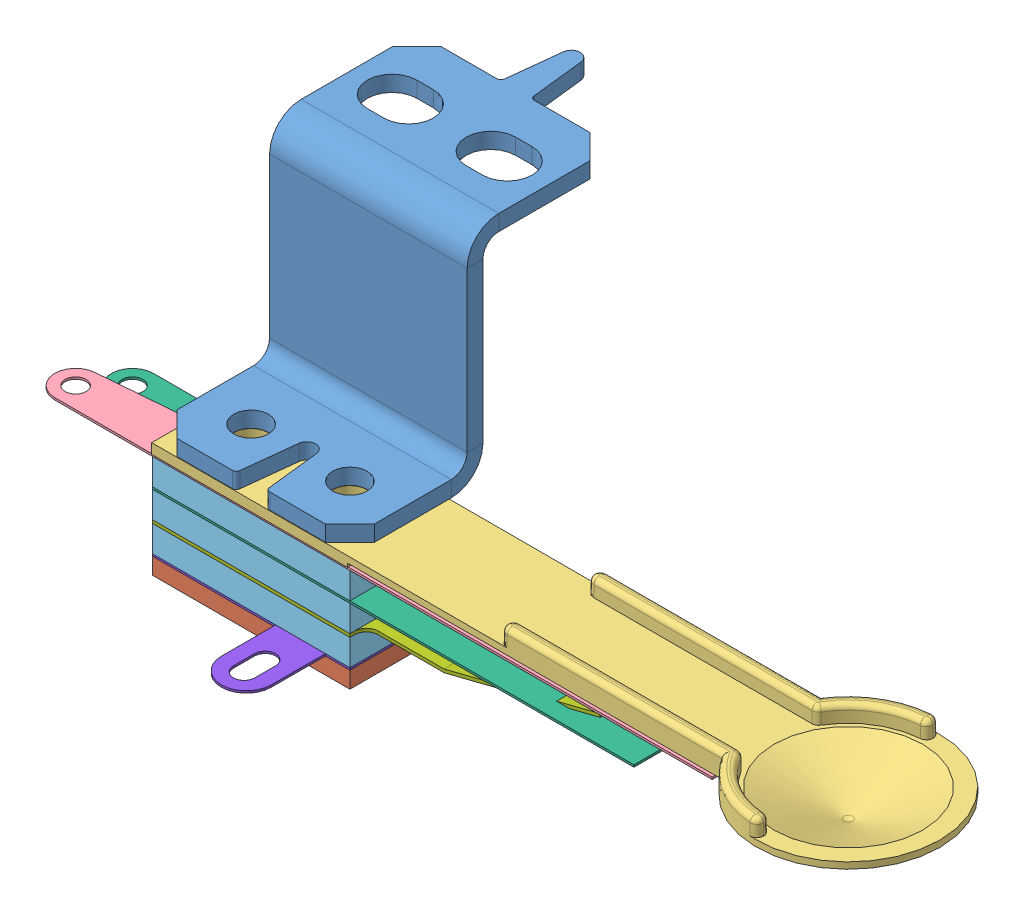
SolidWorks assembly pop Bumper Switch-Bracket Stack 180-5015-05.SLDASM, configuration Default (file format 6000). Lengths in mm.
Overall size (82.61 32.55 39.34).
10 component instances, 8 part files, 27 mates.
Components (placement in the parent):
- Pop Bumper Switch Bracket WPC 01-1168-1: Pop Bumper Switch Bracket WPC 01-1168.SLDPRT [Default] at origin size (19.05 21.46 31.72)
- Pop Bumper Switch Spacer .0625-1: Pop Bumper Switch Spacer .0625.SLDPRT [Default] at (0 -32.5501 6.5405) size (19.05 1.59 9.53)
- Pop Bumper Spoon-1: Pop Bumper Spoon.SLDPRT [Default] at (17.9472 -22.0726 6.5405) x (0 0 1) z (-1 0 0) size (17.67 5.01 71.2)
- Pop Bumper Switch Leaf A-1: Pop Bumper Switch Leaf A.SLDPRT [Default] at (0 -22.6314 6.5405) size (65.41 0.46 9.53)
- Pop Bumper Switch Spacer .100-2: Pop Bumper Switch Spacer .100.SLDPRT [Default] at (0 -25.1714 6.5405) size (19.05 2.54 9.53)
- Pop Bumper Switch Leaf B-1: Pop Bumper Switch Leaf B.SLDPRT [Default] at (0 -25.1714 6.5405) x (1 0 0) z (0 0 -1) size (57.86 0.46 9.53)
- Pop Bumper Switch Spacer .100-3: Pop Bumper Switch Spacer .100.SLDPRT [Default] at (0 -27.9146 6.5405) size (19.05 2.54 9.53)
- Pop Bumper Switch Leaf c-1: Pop Bumper Switch Leaf c.SLDPRT [Default] at (0 -27.9146 6.5405) x (1 0 0) z (0 0 -1) size (41.59 4.09 9.53)
- Pop Bumper Switch Spacer .100-4: Pop Bumper Switch Spacer .100.SLDPRT [Default] at (0 -30.7594 6.5405) size (19.05 2.54 9.53)
- Pop Bumper Switch Leaf D-1: Pop Bumper Switch Leaf D.SLDPRT [Default] at (0 -30.7594 6.5405) x (1 0 0) z (0 0 -1) size (19.05 0.2 17.14)
Mates (geometry in assembly coordinates):
- Concentric1: concentric anti-aligned: cylinder of Pop Bumper Switch Bracket WPC 01-1168-1 through (4.7625 -21.463 6.5405) axis (0 1 0) radius 1.6637; cylinder of Pop Bumper Switch Spacer .0625-1 through (4.7625 -41.4828 6.5405) axis (0 -1 0) radius 1.9812
- Parallel1: parallel aligned: plane of Pop Bumper Switch Bracket WPC 01-1168-1 through (9.525 -21.463 11.303) normal (0 0 1); plane of Pop Bumper Switch Spacer .0625-1 through (-9.525 -41.4828 11.303) normal (0 0 1)
- Coincident3: coincident anti-aligned: plane of Pop Bumper Switch Bracket WPC 01-1168-1 through (9.525 -21.463 0) normal (0 -1 0); plane of Pop Bumper Spoon-1 through (17.9472 -21.463 6.5405) normal (0 1 0)
- Concentric2: concentric aligned: circle of Pop Bumper Switch Bracket WPC 01-1168-1; circle of Pop Bumper Spoon-1
- Concentric3: concentric aligned: cylinder of Pop Bumper Switch Bracket WPC 01-1168-1 through (-4.7625 -21.463 6.5405) axis (0 1 0) radius 1.6637; cylinder of Pop Bumper Spoon-1 through (-4.7625 -24.8666 6.5405) axis (0 1 0) radius 1.6383
- Coincident13: coincident anti-aligned: plane of Pop Bumper Spoon-1 through (17.9472 -22.4282 6.5405) normal (0 -1 0); plane of Pop Bumper Switch Leaf A-1 through (0 -22.4282 6.5405) normal (0 1 0)
- Concentric6: concentric aligned: cylinder of Pop Bumper Spoon-1 through (4.7625 -24.8666 6.5405) axis (0 1 0) radius 1.6383; circle of Pop Bumper Switch Leaf A-1
- Concentric7: concentric aligned: cylinder of Pop Bumper Spoon-1 through (-4.7625 -24.8666 6.5405) axis (0 1 0) radius 1.6383; circle of Pop Bumper Switch Leaf A-1
- Coincident14: coincident anti-aligned: cylinder of Pop Bumper Switch Spacer .100-2 through (4.7625 -22.6314 6.5405) axis (0 -1 0) radius 1.9812; circle of Pop Bumper Switch Leaf A-1
- Coincident15: coincident anti-aligned: plane of Pop Bumper Switch Leaf A-1 through (0 -22.6314 6.5405) normal (0 -1 0); plane of Pop Bumper Switch Spacer .100-2 through (0 -22.6314 6.5405) normal (0 1 0)
- Concentric8: concentric anti-aligned: circle of Pop Bumper Spoon-1; cylinder of Pop Bumper Switch Spacer .100-2 through (-4.7625 -22.6314 6.5405) axis (0 -1 0) radius 1.9812
- Coincident17: coincident anti-aligned: plane of Pop Bumper Switch Spacer .100-2 through (0 -25.1714 6.5405) normal (0 -1 0); plane of Pop Bumper Switch Leaf B-1 through (0 -25.1714 6.5405) normal (0 1 0)
- Coincident18: coincident aligned: cylinder of Pop Bumper Switch Spacer .100-2 through (4.7625 -22.6314 6.5405) axis (0 -1 0) radius 1.9812; circle of Pop Bumper Switch Leaf B-1
- Coincident19: coincident aligned: cylinder of Pop Bumper Switch Spacer .100-2 through (-4.7625 -22.6314 6.5405) axis (0 -1 0) radius 1.9812; circle of Pop Bumper Switch Leaf B-1
- Coincident20: coincident anti-aligned: plane of Pop Bumper Switch Leaf B-1 through (0 -25.3746 6.5405) normal (0 -1 0); plane of Pop Bumper Switch Spacer .100-3 through (0 -25.3746 6.5405) normal (0 1 0)
- Concentric9: concentric aligned: cylinder of Pop Bumper Switch Spacer .100-2 through (4.7625 -22.6314 6.5405) axis (0 -1 0) radius 1.9812; cylinder of Pop Bumper Switch Spacer .100-3 through (4.7625 -25.3746 6.5405) axis (0 -1 0) radius 1.9812
- Concentric10: concentric anti-aligned: cylinder of Pop Bumper Switch Bracket WPC 01-1168-1 through (-4.7625 -21.463 6.5405) axis (0 1 0) radius 1.6637; cylinder of Pop Bumper Switch Spacer .100-3 through (-4.7625 -25.3746 6.5405) axis (0 -1 0) radius 1.9812
- Coincident21: coincident anti-aligned: plane of Pop Bumper Switch Spacer .100-3 through (0 -27.9146 6.5405) normal (0 -1 0); plane of Pop Bumper Switch Leaf c-1 through (0 -27.9146 6.5405) normal (0 1 0)
- Coincident22: coincident aligned: cylinder of Pop Bumper Switch Spacer .100-3 through (4.7625 -25.3746 6.5405) axis (0 -1 0) radius 1.9812; circle of Pop Bumper Switch Leaf c-1
- Coincident23: coincident aligned: cylinder of Pop Bumper Switch Spacer .100-3 through (-4.7625 -25.3746 6.5405) axis (0 -1 0) radius 1.9812; circle of Pop Bumper Switch Leaf c-1
- Concentric11: concentric aligned: cylinder of Pop Bumper Switch Spacer .100-3 through (4.7625 -25.3746 6.5405) axis (0 -1 0) radius 1.9812; cylinder of Pop Bumper Switch Spacer .100-4 through (4.7625 -28.2194 6.5405) axis (0 -1 0) radius 1.9812
- Concentric12: concentric aligned: cylinder of Pop Bumper Switch Spacer .100-3 through (-4.7625 -25.3746 6.5405) axis (0 -1 0) radius 1.9812; cylinder of Pop Bumper Switch Spacer .100-4 through (-4.7625 -28.2194 6.5405) axis (0 -1 0) radius 1.9812
- Coincident24: coincident anti-aligned: plane of Pop Bumper Switch Leaf c-1 through (0 -28.2194 6.5405) normal (0 -1 0); plane of Pop Bumper Switch Spacer .100-4 through (0 -28.2194 6.5405) normal (0 1 0)
- Coincident25: coincident: line of Pop Bumper Switch Spacer .100-4 through (9.525 -30.7594 1.778) axis (-1 0 0); plane of Pop Bumper Switch Leaf D-1 through (0 -30.7594 6.5405) normal (0 1 0)
- Coincident26: coincident aligned: cylinder of Pop Bumper Switch Spacer .100-4 through (4.7625 -28.2194 6.5405) axis (0 -1 0) radius 1.9812; circle of Pop Bumper Switch Leaf D-1
- Coincident27: coincident aligned: cylinder of Pop Bumper Switch Spacer .100-4 through (-4.7625 -28.2194 6.5405) axis (0 -1 0) radius 1.9812; circle of Pop Bumper Switch Leaf D-1
- Coincident28: coincident anti-aligned: plane of Pop Bumper Switch Spacer .0625-1 through (0 -30.9626 6.5405) normal (0 1 0); plane of Pop Bumper Switch Leaf D-1 through (0 -30.9626 6.5405) normal (0 -1 0)
